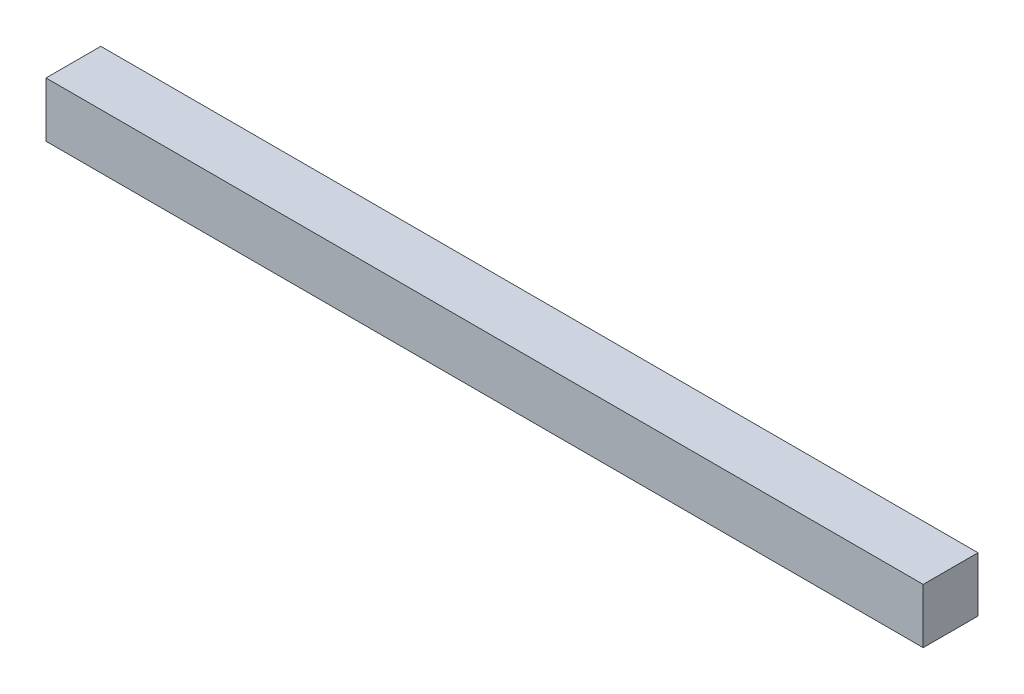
from build123d import *

# Parameters (mm, degrees)
SKETCH2_W      = 6.35
SKETCH2_H      = 6.35
EXTRUDE1_DEPTH = 101.6


with BuildPart() as part:
    # Sketch2 → Extrude1 (new body)
    with BuildSketch(Plane(origin=(0, 0, 0), x_dir=(0, 0, -1), z_dir=(1, 0, 0))):
        with Locations((3.175, 3.175)):
            Rectangle(SKETCH2_W, SKETCH2_H)
    extrude(amount=EXTRUDE1_DEPTH)


solid = part.part
